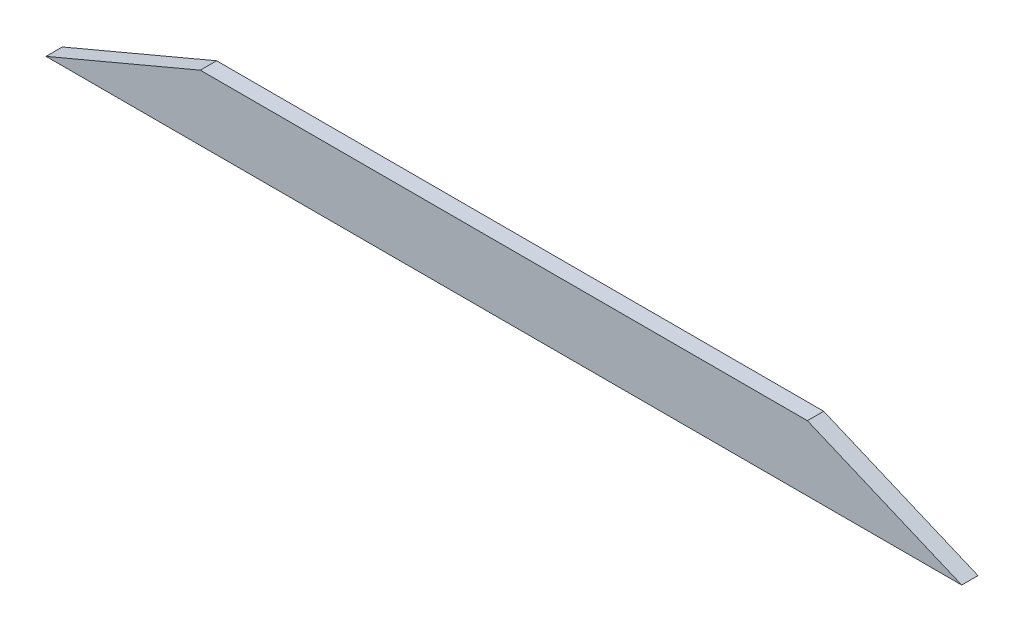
from build123d import *

# Parameters (mm, degrees)
BOSS_EXTRUDE1_DEPTH = 25.4


with BuildPart() as part:
    # Sketch1 → Boss-Extrude1 (new body)
    with BuildSketch(Plane.XY):
        Polygon((-473.022903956, 50.8), (473.022903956, 50.8), (713.476237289, -50.8), (-713.476237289, -50.8), align=None)
    extrude(amount=BOSS_EXTRUDE1_DEPTH)


solid = part.part
